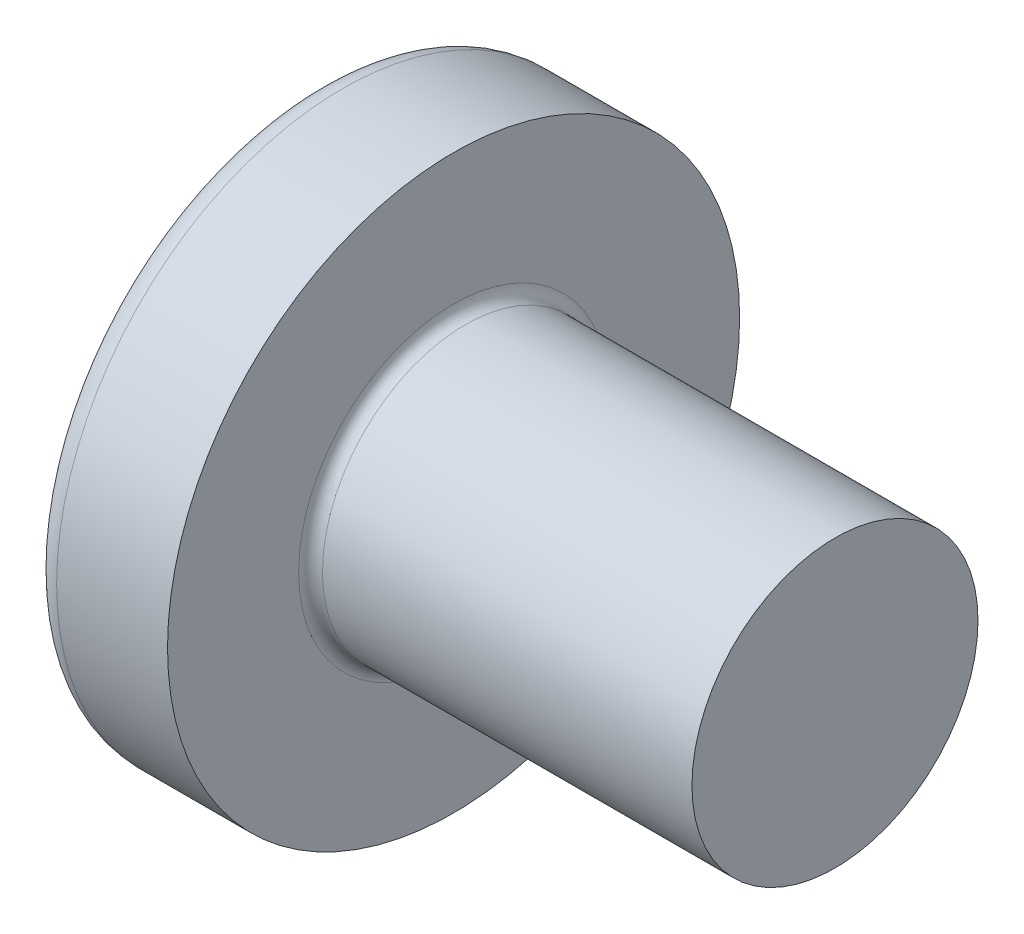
from build123d import *

# Parameters (mm, degrees)
FILLET1_R    = 0.25
RECPAT_COUNT = 2
RECPAT_ANGLE = 90


with BuildPart() as part:
    # BodySke → Base-Revolve (revolve)
    with BuildSketch(Plane.XY, mode=Mode.PRIVATE) as base_revolve_sk:
        with BuildLine():
            Line((4.6, 3), (4.6, 6))
            Line((4.6, 6), (2.274716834, 6))
            ThreePointArc((2.274716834, 6), (2.026424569, 5.939532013), (1.833738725, 5.77167019))
            ThreePointArc((1.833738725, 5.77167019), (0.469454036, 3.027985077), (0, 0))
            Line((0, 0), (12.6, 0))
            Line((12.6, 0), (12.6, 3))
            Line((12.6, 3), (4.6, 3))
        make_face()
    revolve(base_revolve_sk.sketch.rotate(Axis((2.274716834, 0, 0), (1, 0, 0)), 90), axis=Axis((2.274716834, 0, 0), (1, 0, 0)))

    # Fillet1
    fillet1_edges = [part.edges().sort_by_distance(p)[0] for p in [
        (4.6, 0, -3),
    ]]
    fillet(fillet1_edges, radius=FILLET1_R)

    # Sketch3 → Recess section 0
    with BuildSketch(Plane(origin=(0, 0, 0), x_dir=(0, 0, -1), z_dir=(1, 0, 0))):
        with BuildLine():
            Line((0.71, -3.35), (-0.71, -3.35))
            Line((-0.71, -3.35), (-0.71, 3.35))
            Line((-0.71, 3.35), (0.71, 3.35))
            Line((0.71, 3.35), (0.71, -3.35))
        make_face()
    # Sketch4 → Recess section 1
    with BuildSketch(Plane(origin=(3.46, 0, 0), x_dir=(0, 0, -1), z_dir=(1, 0, 0))):
        with BuildLine():
            Line((0.71, -1.624907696), (-0.71, -1.624907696))
            Line((-0.71, -1.624907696), (-0.71, 1.624907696))
            Line((-0.71, 1.624907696), (0.71, 1.624907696))
            Line((0.71, 1.624907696), (0.71, -1.624907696))
        make_face()
    recess = loft(mode=Mode.SUBTRACT)

    # RecPat: Recess ×2 about axis
    recpat_axis = Axis((0, 0, 0), (1, 0, 0))
    for i in range(1, RECPAT_COUNT):
        add(recess.rotate(recpat_axis, i * RECPAT_ANGLE / (RECPAT_COUNT - 1)), mode=Mode.SUBTRACT)

    # RecCorSke → RecessCore (revolve, cut)
    with BuildSketch(Plane.XY, mode=Mode.PRIVATE) as recesscore_sk:
        Polygon((0, 0), (0, 1.522446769), (3.46, 1.2805), (3.876059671, 0), align=None)
    revolve(recesscore_sk.sketch.rotate(Axis((-3.175, 0, 0), (1, 0, 0)), 12.930792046), axis=Axis((-3.175, 0, 0), (1, 0, 0)), mode=Mode.SUBTRACT)


solid = part.part
